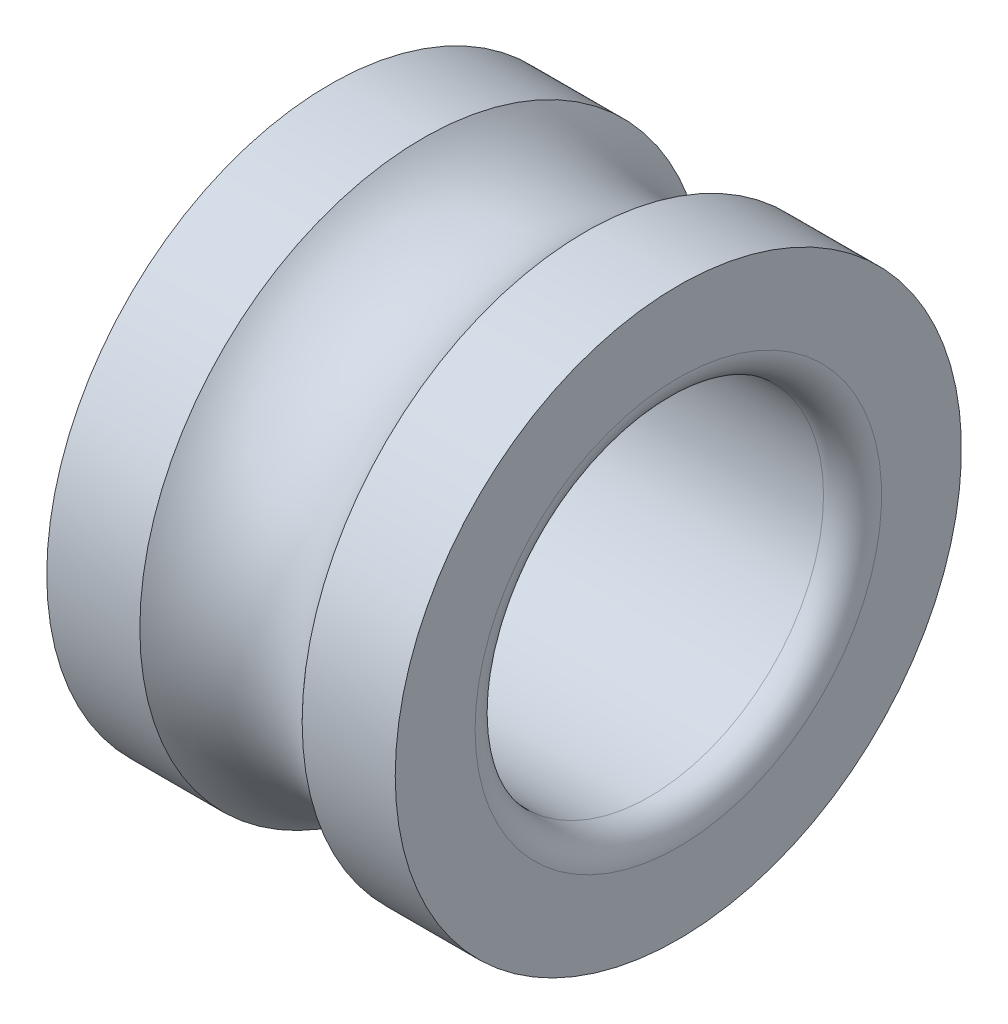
from build123d import *


with BuildPart() as part:
    # Esquisse1 → Base-R_volution (revolve)
    with BuildSketch(Plane(origin=(0, 0, 0), x_dir=(1, 0, 0), z_dir=(0, 1, 0)), mode=Mode.PRIVATE) as base_r_volution_sk:
        with BuildLine():
            Line((0, 9.75), (0, 7))
            ThreePointArc((0, 7), (0.292893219, 6.292893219), (1, 6))
            Line((1, 6), (11, 6))
            ThreePointArc((11, 6), (11.707106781, 6.292893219), (12, 7))
            Line((12, 7), (12, 9.75))
            Line((12, 9.75), (8.795084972, 9.75))
            ThreePointArc((8.795084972, 9.75), (6, 8.5), (3.204915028, 9.75))
            Line((3.204915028, 9.75), (0, 9.75))
        make_face()
    revolve(base_r_volution_sk.sketch.rotate(Axis((0, 0, 0), (1, 0, 0)), 180), axis=Axis((0, 0, 0), (1, 0, 0)))


solid = part.part
